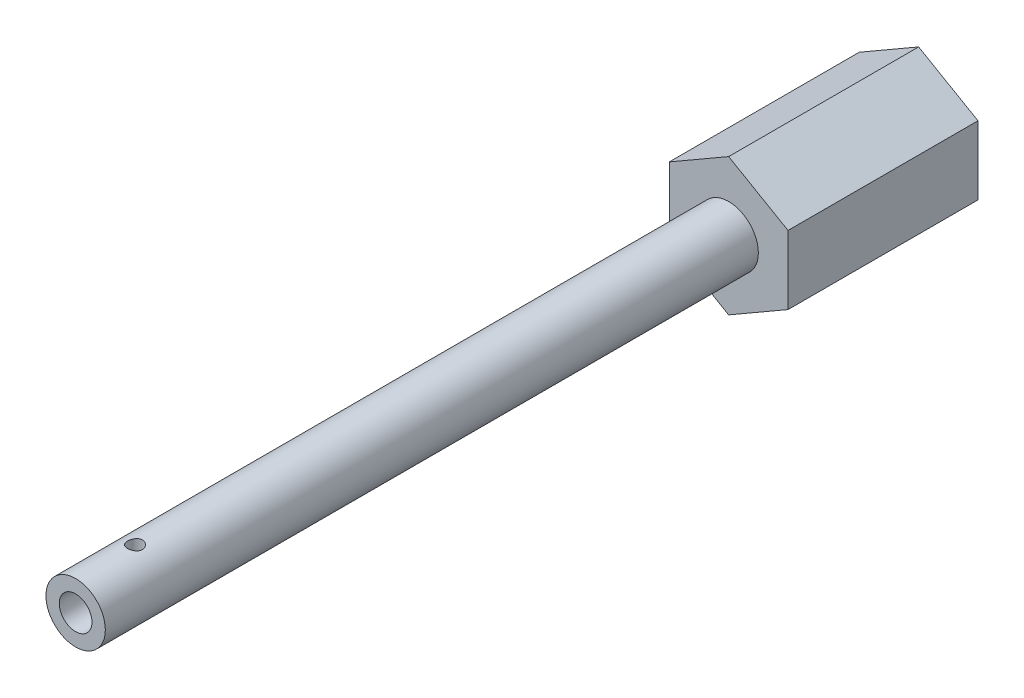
ISO-10303-21;
HEADER;
FILE_DESCRIPTION(('STEP AP214'),'2;1');
FILE_NAME('part.step','',(''),(''),'','','');
FILE_SCHEMA(('AUTOMOTIVE_DESIGN { 1 0 10303 214 1 1 1 1 }'));
ENDSEC;
DATA;
#1=APPLICATION_CONTEXT('core data for automotive mechanical design processes');
#2=APPLICATION_PROTOCOL_DEFINITION('international standard','automotive_design',2000,#1);
#3=PRODUCT_CONTEXT('',#1,'mechanical');
#4=PRODUCT('Part','Part','',(#3));
#5=PRODUCT_RELATED_PRODUCT_CATEGORY('part','',(#4));
#6=PRODUCT_DEFINITION_FORMATION('','',#4);
#7=PRODUCT_DEFINITION_CONTEXT('part definition',#1,'design');
#8=PRODUCT_DEFINITION('design','',#6,#7);
#9=PRODUCT_DEFINITION_SHAPE('','',#8);
#10=(LENGTH_UNIT() NAMED_UNIT(*) SI_UNIT(.MILLI.,.METRE.));
#11=(NAMED_UNIT(*) PLANE_ANGLE_UNIT() SI_UNIT($,.RADIAN.));
#12=(NAMED_UNIT(*) SI_UNIT($,.STERADIAN.) SOLID_ANGLE_UNIT());
#13=UNCERTAINTY_MEASURE_WITH_UNIT(LENGTH_MEASURE(1.E-05),#10,'distance_accuracy_value','');
#14=(GEOMETRIC_REPRESENTATION_CONTEXT(3) GLOBAL_UNCERTAINTY_ASSIGNED_CONTEXT((#13)) GLOBAL_UNIT_ASSIGNED_CONTEXT((#10,
#11,#12)) REPRESENTATION_CONTEXT('',''));
#15=CARTESIAN_POINT('',(0.,0.,0.));
#16=DIRECTION('',(0.,0.,1.));
#17=DIRECTION('',(1.,0.,0.));
#18=AXIS2_PLACEMENT_3D('',#15,#16,#17);
#19=CARTESIAN_POINT('',(6.35000000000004,-3.66617420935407,20.32));
#20=DIRECTION('',(-1.,0.,0.));
#21=DIRECTION('',(0.,-1.,0.));
#22=AXIS2_PLACEMENT_3D('',#19,#20,#21);
#23=PLANE('',#22);
#24=DIRECTION('',(0.,1.,0.));
#25=VECTOR('',#24,1.);
#26=CARTESIAN_POINT('',(6.35000000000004,-3.66617420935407,0.));
#27=LINE('',#26,#25);
#28=CARTESIAN_POINT('',(6.35000000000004,-3.66617420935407,0.));
#29=VERTEX_POINT('',#28);
#30=CARTESIAN_POINT('',(6.34999999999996,3.6661742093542,0.));
#31=VERTEX_POINT('',#30);
#32=EDGE_CURVE('E142',#29,#31,#27,.T.);
#33=ORIENTED_EDGE('',*,*,#32,.T.);
#34=DIRECTION('',(0.,0.,-1.));
#35=VECTOR('',#34,1.);
#36=CARTESIAN_POINT('',(6.34999999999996,3.6661742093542,20.32));
#37=LINE('',#36,#35);
#38=CARTESIAN_POINT('',(6.34999999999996,3.6661742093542,20.32));
#39=VERTEX_POINT('',#38);
#40=EDGE_CURVE('E58',#39,#31,#37,.T.);
#41=ORIENTED_EDGE('',*,*,#40,.F.);
#42=DIRECTION('',(0.,1.,0.));
#43=VECTOR('',#42,1.);
#44=CARTESIAN_POINT('',(6.35000000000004,-3.66617420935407,20.32));
#45=LINE('',#44,#43);
#46=CARTESIAN_POINT('',(6.35000000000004,-3.66617420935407,20.32));
#47=VERTEX_POINT('',#46);
#48=EDGE_CURVE('E159',#47,#39,#45,.T.);
#49=ORIENTED_EDGE('',*,*,#48,.F.);
#50=DIRECTION('',(0.,0.,-1.));
#51=VECTOR('',#50,1.);
#52=CARTESIAN_POINT('',(6.35000000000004,-3.66617420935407,20.32));
#53=LINE('',#52,#51);
#54=EDGE_CURVE('E138',#47,#29,#53,.T.);
#55=ORIENTED_EDGE('',*,*,#54,.T.);
#56=EDGE_LOOP('',(#33,#41,#49,#55));
#57=FACE_BOUND('',#56,.T.);
#58=ADVANCED_FACE('F43',(#57),#23,.F.);
#59=CARTESIAN_POINT('',(6.34999999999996,3.6661742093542,20.32));
#60=DIRECTION('',(-0.499999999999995,-0.866025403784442,0.));
#61=DIRECTION('',(0.866025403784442,-0.499999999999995,0.));
#62=AXIS2_PLACEMENT_3D('',#59,#60,#61);
#63=PLANE('',#62);
#64=DIRECTION('',(-0.866025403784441,0.499999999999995,0.));
#65=VECTOR('',#64,1.);
#66=CARTESIAN_POINT('',(6.34999999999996,3.6661742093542,0.));
#67=LINE('',#66,#65);
#68=CARTESIAN_POINT('',(0.,7.33234841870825,0.));
#69=VERTEX_POINT('',#68);
#70=EDGE_CURVE('E146',#31,#69,#67,.T.);
#71=ORIENTED_EDGE('',*,*,#70,.T.);
#72=DIRECTION('',(0.,0.,-1.));
#73=VECTOR('',#72,1.);
#74=CARTESIAN_POINT('',(0.,7.33234841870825,20.32));
#75=LINE('',#74,#73);
#76=CARTESIAN_POINT('',(0.,7.33234841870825,20.32));
#77=VERTEX_POINT('',#76);
#78=EDGE_CURVE('E166',#77,#69,#75,.T.);
#79=ORIENTED_EDGE('',*,*,#78,.F.);
#80=DIRECTION('',(-0.866025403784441,0.499999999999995,0.));
#81=VECTOR('',#80,1.);
#82=CARTESIAN_POINT('',(6.34999999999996,3.6661742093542,20.32));
#83=LINE('',#82,#81);
#84=EDGE_CURVE('E106',#39,#77,#83,.T.);
#85=ORIENTED_EDGE('',*,*,#84,.F.);
#86=ORIENTED_EDGE('',*,*,#40,.T.);
#87=EDGE_LOOP('',(#71,#79,#85,#86));
#88=FACE_BOUND('',#87,.T.);
#89=ADVANCED_FACE('F226',(#88),#63,.F.);
#90=CARTESIAN_POINT('',(0.,7.33234841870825,20.32));
#91=DIRECTION('',(0.500000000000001,-0.866025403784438,0.));
#92=DIRECTION('',(0.866025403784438,0.500000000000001,0.));
#93=AXIS2_PLACEMENT_3D('',#90,#91,#92);
#94=PLANE('',#93);
#95=DIRECTION('',(-0.866025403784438,-0.500000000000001,0.));
#96=VECTOR('',#95,1.);
#97=CARTESIAN_POINT('',(0.,7.33234841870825,0.));
#98=LINE('',#97,#96);
#99=CARTESIAN_POINT('',(-6.35000000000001,3.66617420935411,0.));
#100=VERTEX_POINT('',#99);
#101=EDGE_CURVE('E150',#69,#100,#98,.T.);
#102=ORIENTED_EDGE('',*,*,#101,.T.);
#103=DIRECTION('',(0.,0.,-1.));
#104=VECTOR('',#103,1.);
#105=CARTESIAN_POINT('',(-6.35000000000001,3.66617420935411,20.32));
#106=LINE('',#105,#104);
#107=CARTESIAN_POINT('',(-6.35000000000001,3.66617420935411,20.32));
#108=VERTEX_POINT('',#107);
#109=EDGE_CURVE('E131',#108,#100,#106,.T.);
#110=ORIENTED_EDGE('',*,*,#109,.F.);
#111=DIRECTION('',(-0.866025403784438,-0.500000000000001,0.));
#112=VECTOR('',#111,1.);
#113=CARTESIAN_POINT('',(0.,7.33234841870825,20.32));
#114=LINE('',#113,#112);
#115=EDGE_CURVE('E120',#77,#108,#114,.T.);
#116=ORIENTED_EDGE('',*,*,#115,.F.);
#117=ORIENTED_EDGE('',*,*,#78,.T.);
#118=EDGE_LOOP('',(#102,#110,#116,#117));
#119=FACE_BOUND('',#118,.T.);
#120=ADVANCED_FACE('F224',(#119),#94,.F.);
#121=CARTESIAN_POINT('',(-6.35000000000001,3.66617420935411,20.32));
#122=DIRECTION('',(1.,0.,0.));
#123=DIRECTION('',(0.,1.,0.));
#124=AXIS2_PLACEMENT_3D('',#121,#122,#123);
#125=PLANE('',#124);
#126=DIRECTION('',(0.,-1.,0.));
#127=VECTOR('',#126,1.);
#128=CARTESIAN_POINT('',(-6.35000000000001,3.66617420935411,0.));
#129=LINE('',#128,#127);
#130=CARTESIAN_POINT('',(-6.34999999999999,-3.66617420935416,0.));
#131=VERTEX_POINT('',#130);
#132=EDGE_CURVE('E129',#100,#131,#129,.T.);
#133=ORIENTED_EDGE('',*,*,#132,.T.);
#134=DIRECTION('',(0.,0.,-1.));
#135=VECTOR('',#134,1.);
#136=CARTESIAN_POINT('',(-6.34999999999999,-3.66617420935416,20.32));
#137=LINE('',#136,#135);
#138=CARTESIAN_POINT('',(-6.34999999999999,-3.66617420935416,20.32));
#139=VERTEX_POINT('',#138);
#140=EDGE_CURVE('E126',#139,#131,#137,.T.);
#141=ORIENTED_EDGE('',*,*,#140,.F.);
#142=DIRECTION('',(0.,-1.,0.));
#143=VECTOR('',#142,1.);
#144=CARTESIAN_POINT('',(-6.35000000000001,3.66617420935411,20.32));
#145=LINE('',#144,#143);
#146=EDGE_CURVE('E114',#108,#139,#145,.T.);
#147=ORIENTED_EDGE('',*,*,#146,.F.);
#148=ORIENTED_EDGE('',*,*,#109,.T.);
#149=EDGE_LOOP('',(#133,#141,#147,#148));
#150=FACE_BOUND('',#149,.T.);
#151=ADVANCED_FACE('F127',(#150),#125,.F.);
#152=CARTESIAN_POINT('',(-6.34999999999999,-3.66617420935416,20.32));
#153=DIRECTION('',(0.499999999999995,0.866025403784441,0.));
#154=DIRECTION('',(-0.866025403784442,0.499999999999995,0.));
#155=AXIS2_PLACEMENT_3D('',#152,#153,#154);
#156=PLANE('',#155);
#157=DIRECTION('',(0.866025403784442,-0.499999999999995,0.));
#158=VECTOR('',#157,1.);
#159=CARTESIAN_POINT('',(-6.34999999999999,-3.66617420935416,0.));
#160=LINE('',#159,#158);
#161=CARTESIAN_POINT('',(0.,-7.33234841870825,0.));
#162=VERTEX_POINT('',#161);
#163=EDGE_CURVE('E91',#131,#162,#160,.T.);
#164=ORIENTED_EDGE('',*,*,#163,.T.);
#165=DIRECTION('',(0.,0.,-1.));
#166=VECTOR('',#165,1.);
#167=CARTESIAN_POINT('',(0.,-7.33234841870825,20.32));
#168=LINE('',#167,#166);
#169=CARTESIAN_POINT('',(0.,-7.33234841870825,20.32));
#170=VERTEX_POINT('',#169);
#171=EDGE_CURVE('E132',#170,#162,#168,.T.);
#172=ORIENTED_EDGE('',*,*,#171,.F.);
#173=DIRECTION('',(0.866025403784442,-0.499999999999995,0.));
#174=VECTOR('',#173,1.);
#175=CARTESIAN_POINT('',(-6.34999999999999,-3.66617420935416,20.32));
#176=LINE('',#175,#174);
#177=EDGE_CURVE('E118',#139,#170,#176,.T.);
#178=ORIENTED_EDGE('',*,*,#177,.F.);
#179=ORIENTED_EDGE('',*,*,#140,.T.);
#180=EDGE_LOOP('',(#164,#172,#178,#179));
#181=FACE_BOUND('',#180,.T.);
#182=ADVANCED_FACE('F134',(#181),#156,.F.);
#183=CARTESIAN_POINT('',(0.,-7.33234841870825,20.32));
#184=DIRECTION('',(-0.500000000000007,0.866025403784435,0.));
#185=DIRECTION('',(-0.866025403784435,-0.500000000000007,0.));
#186=AXIS2_PLACEMENT_3D('',#183,#184,#185);
#187=PLANE('',#186);
#188=DIRECTION('',(0.866025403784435,0.500000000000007,0.));
#189=VECTOR('',#188,1.);
#190=CARTESIAN_POINT('',(0.,-7.33234841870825,0.));
#191=LINE('',#190,#189);
#192=EDGE_CURVE('E97',#162,#29,#191,.T.);
#193=ORIENTED_EDGE('',*,*,#192,.T.);
#194=ORIENTED_EDGE('',*,*,#54,.F.);
#195=DIRECTION('',(0.866025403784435,0.500000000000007,0.));
#196=VECTOR('',#195,1.);
#197=CARTESIAN_POINT('',(0.,-7.33234841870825,20.32));
#198=LINE('',#197,#196);
#199=EDGE_CURVE('E67',#170,#47,#198,.T.);
#200=ORIENTED_EDGE('',*,*,#199,.F.);
#201=ORIENTED_EDGE('',*,*,#171,.T.);
#202=EDGE_LOOP('',(#193,#194,#200,#201));
#203=FACE_BOUND('',#202,.T.);
#204=ADVANCED_FACE('F213',(#203),#187,.F.);
#205=CARTESIAN_POINT('',(0.,0.,20.32));
#206=DIRECTION('',(0.,0.,1.));
#207=DIRECTION('',(1.,0.,0.));
#208=AXIS2_PLACEMENT_3D('',#205,#206,#207);
#209=PLANE('',#208);
#210=CARTESIAN_POINT('',(0.,0.,20.32));
#211=DIRECTION('',(0.,0.,1.));
#212=DIRECTION('',(1.,0.,0.));
#213=AXIS2_PLACEMENT_3D('',#210,#211,#212);
#214=CIRCLE('',#213,3.175);
#215=CARTESIAN_POINT('',(3.175,0.,20.32));
#216=VERTEX_POINT('',#215);
#217=EDGE_CURVE('E11',#216,#216,#214,.T.);
#218=ORIENTED_EDGE('',*,*,#217,.F.);
#219=EDGE_LOOP('',(#218));
#220=FACE_BOUND('',#219,.T.);
#221=ORIENTED_EDGE('',*,*,#48,.T.);
#222=ORIENTED_EDGE('',*,*,#84,.T.);
#223=ORIENTED_EDGE('',*,*,#115,.T.);
#224=ORIENTED_EDGE('',*,*,#146,.T.);
#225=ORIENTED_EDGE('',*,*,#177,.T.);
#226=ORIENTED_EDGE('',*,*,#199,.T.);
#227=EDGE_LOOP('',(#221,#222,#223,#224,#225,#226));
#228=FACE_BOUND('',#227,.T.);
#229=ADVANCED_FACE('F116',(#220,#228),#209,.T.);
#230=CARTESIAN_POINT('',(0.,0.,0.));
#231=DIRECTION('',(0.,0.,1.));
#232=DIRECTION('',(1.,0.,0.));
#233=AXIS2_PLACEMENT_3D('',#230,#231,#232);
#234=PLANE('',#233);
#235=ORIENTED_EDGE('',*,*,#32,.F.);
#236=ORIENTED_EDGE('',*,*,#192,.F.);
#237=ORIENTED_EDGE('',*,*,#163,.F.);
#238=ORIENTED_EDGE('',*,*,#132,.F.);
#239=ORIENTED_EDGE('',*,*,#101,.F.);
#240=ORIENTED_EDGE('',*,*,#70,.F.);
#241=EDGE_LOOP('',(#235,#236,#237,#238,#239,#240));
#242=FACE_BOUND('',#241,.T.);
#243=ADVANCED_FACE('F208',(#242),#234,.F.);
#244=CARTESIAN_POINT('',(0.,0.,90.17));
#245=DIRECTION('',(0.,0.,-1.));
#246=DIRECTION('',(-1.,0.,0.));
#247=AXIS2_PLACEMENT_3D('',#244,#245,#246);
#248=CYLINDRICAL_SURFACE('',#247,3.175);
#249=CARTESIAN_POINT('',(0.,-3.175,84.61375));
#250=CARTESIAN_POINT('',(0.0438552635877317,-3.17499925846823,84.6137487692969));
#251=CARTESIAN_POINT('',(0.0877242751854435,-3.17408230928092,84.6101032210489));
#252=CARTESIAN_POINT('',(0.174205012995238,-3.17051326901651,84.5956391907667));
#253=CARTESIAN_POINT('',(0.216816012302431,-3.167860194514,84.5848166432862));
#254=CARTESIAN_POINT('',(0.299519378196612,-3.16111268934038,84.5563675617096));
#255=CARTESIAN_POINT('',(0.339614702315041,-3.15701999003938,84.5387491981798));
#256=CARTESIAN_POINT('',(0.416280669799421,-3.14782911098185,84.4972373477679));
#257=CARTESIAN_POINT('',(0.452851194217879,-3.14273089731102,84.4733436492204));
#258=CARTESIAN_POINT('',(0.522182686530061,-3.13196506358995,84.4194395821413));
#259=CARTESIAN_POINT('',(0.554860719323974,-3.12628865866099,84.3893242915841));
#260=CARTESIAN_POINT('',(0.61475880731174,-3.11506457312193,84.324056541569));
#261=CARTESIAN_POINT('',(0.64197824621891,-3.10951690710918,84.2889035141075));
#262=CARTESIAN_POINT('',(0.690576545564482,-3.0990898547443,84.2139141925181));
#263=CARTESIAN_POINT('',(0.711862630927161,-3.09422162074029,84.1740160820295));
#264=CARTESIAN_POINT('',(0.747393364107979,-3.08583274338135,84.0910664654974));
#265=CARTESIAN_POINT('',(0.76163913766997,-3.08231188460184,84.0480154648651));
#266=CARTESIAN_POINT('',(0.782401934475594,-3.07710668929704,83.9608940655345));
#267=CARTESIAN_POINT('',(0.789068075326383,-3.07538697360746,83.916861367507));
#268=CARTESIAN_POINT('',(0.794946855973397,-3.07387287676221,83.8282716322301));
#269=CARTESIAN_POINT('',(0.794160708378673,-3.07407818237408,83.7837146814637));
#270=CARTESIAN_POINT('',(0.785276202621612,-3.07635912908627,83.6964841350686));
#271=CARTESIAN_POINT('',(0.777355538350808,-3.07838931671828,83.6537910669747));
#272=CARTESIAN_POINT('',(0.754710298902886,-3.08401883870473,83.5703597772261));
#273=CARTESIAN_POINT('',(0.739985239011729,-3.08761828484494,83.5296216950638));
#274=CARTESIAN_POINT('',(0.703997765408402,-3.09602247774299,83.4507802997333));
#275=CARTESIAN_POINT('',(0.682670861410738,-3.10083902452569,83.4127077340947));
#276=CARTESIAN_POINT('',(0.634130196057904,-3.11112805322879,83.340618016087));
#277=CARTESIAN_POINT('',(0.606915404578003,-3.11660064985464,83.3066015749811));
#278=CARTESIAN_POINT('',(0.546451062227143,-3.12777653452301,83.2425714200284));
#279=CARTESIAN_POINT('',(0.513051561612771,-3.1334819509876,83.2126994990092));
#280=CARTESIAN_POINT('',(0.441648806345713,-3.14433990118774,83.1589537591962));
#281=CARTESIAN_POINT('',(0.403645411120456,-3.14949241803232,83.1350801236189));
#282=CARTESIAN_POINT('',(0.323911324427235,-3.15868966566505,83.0939565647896));
#283=CARTESIAN_POINT('',(0.282168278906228,-3.16273053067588,83.0767296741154));
#284=CARTESIAN_POINT('',(0.196255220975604,-3.16922106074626,83.0495770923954));
#285=CARTESIAN_POINT('',(0.152085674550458,-3.17167103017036,83.0396500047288));
#286=CARTESIAN_POINT('',(0.0637857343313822,-3.17465868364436,83.0275953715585));
#287=CARTESIAN_POINT('',(0.0196832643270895,-3.17524369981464,83.0252747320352));
#288=CARTESIAN_POINT('',(-0.0682798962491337,-3.17457034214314,83.0279692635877));
#289=CARTESIAN_POINT('',(-0.1121406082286,-3.1733121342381,83.0329837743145));
#290=CARTESIAN_POINT('',(-0.19770421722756,-3.1691240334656,83.0500471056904));
#291=CARTESIAN_POINT('',(-0.239429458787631,-3.16621918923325,83.0619905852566));
#292=CARTESIAN_POINT('',(-0.320281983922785,-3.15906523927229,83.0924524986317));
#293=CARTESIAN_POINT('',(-0.359409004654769,-3.15481599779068,83.1109715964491));
#294=CARTESIAN_POINT('',(-0.434722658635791,-3.14533125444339,83.1544332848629));
#295=CARTESIAN_POINT('',(-0.470844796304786,-3.14007958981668,83.1794840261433));
#296=CARTESIAN_POINT('',(-0.538441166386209,-3.12919802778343,83.2351596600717));
#297=CARTESIAN_POINT('',(-0.569914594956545,-3.12356806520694,83.265785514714));
#298=CARTESIAN_POINT('',(-0.628115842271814,-3.11239406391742,83.3326385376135));
#299=CARTESIAN_POINT('',(-0.654708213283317,-3.10685552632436,83.3689847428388));
#300=CARTESIAN_POINT('',(-0.701416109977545,-3.09664564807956,83.4457376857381));
#301=CARTESIAN_POINT('',(-0.721531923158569,-3.09197426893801,83.4861442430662));
#302=CARTESIAN_POINT('',(-0.754565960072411,-3.0840790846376,83.5696542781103));
#303=CARTESIAN_POINT('',(-0.767526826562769,-3.08084672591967,83.6127400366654));
#304=CARTESIAN_POINT('',(-0.785995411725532,-3.07618735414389,83.700572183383));
#305=CARTESIAN_POINT('',(-0.791504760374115,-3.074759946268,83.7453182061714));
#306=CARTESIAN_POINT('',(-0.794828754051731,-3.07390218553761,83.8338223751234));
#307=CARTESIAN_POINT('',(-0.792859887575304,-3.0744156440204,83.8775719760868));
#308=CARTESIAN_POINT('',(-0.781778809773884,-3.07725185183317,83.9640941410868));
#309=CARTESIAN_POINT('',(-0.772666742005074,-3.07957456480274,84.0068667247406));
#310=CARTESIAN_POINT('',(-0.74767615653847,-3.08573625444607,84.0899853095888));
#311=CARTESIAN_POINT('',(-0.731838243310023,-3.08956612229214,84.1303442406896));
#312=CARTESIAN_POINT('',(-0.693877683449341,-3.09831187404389,84.2078608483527));
#313=CARTESIAN_POINT('',(-0.671754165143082,-3.10322790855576,84.2450180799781));
#314=CARTESIAN_POINT('',(-0.621171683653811,-3.11375231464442,84.3161226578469));
#315=CARTESIAN_POINT('',(-0.592562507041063,-3.11937540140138,84.3499609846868));
#316=CARTESIAN_POINT('',(-0.530113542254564,-3.1305924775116,84.4124269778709));
#317=CARTESIAN_POINT('',(-0.496272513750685,-3.13618645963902,84.4410534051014));
#318=CARTESIAN_POINT('',(-0.423580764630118,-3.14683592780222,84.4927884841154));
#319=CARTESIAN_POINT('',(-0.38465041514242,-3.15187982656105,84.5157878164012));
#320=CARTESIAN_POINT('',(-0.303353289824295,-3.16073856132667,84.554878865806));
#321=CARTESIAN_POINT('',(-0.260989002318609,-3.16455427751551,84.5709755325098));
#322=CARTESIAN_POINT('',(-0.18225042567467,-3.16996264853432,84.5934150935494));
#323=CARTESIAN_POINT('',(-0.146251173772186,-3.17183867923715,84.6010241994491));
#324=CARTESIAN_POINT('',(-0.0735044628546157,-3.17435761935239,84.6111919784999));
#325=CARTESIAN_POINT('',(-0.0367570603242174,-3.17500062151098,84.6137510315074));
#326=CARTESIAN_POINT('',(0.,-3.175,84.61375));
#327=B_SPLINE_CURVE_WITH_KNOTS('',3,(#249,#250,#251,#252,#253,#254,#255,#256,#257,#258,#259,
#260,#261,#262,#263,#264,#265,#266,#267,#268,#269,#270,#271,#272,#273,#274,#275,#276,#277,#278,
#279,#280,#281,#282,#283,#284,#285,#286,#287,#288,#289,#290,#291,#292,#293,#294,#295,#296,#297,
#298,#299,#300,#301,#302,#303,#304,#305,#306,#307,#308,#309,#310,#311,#312,#313,#314,#315,#316,
#317,#318,#319,#320,#321,#322,#323,#324,#325,#326),.UNSPECIFIED.,.T.,.F.,(4,2,2,2,2,2,2,2,2,2,2,
2,2,2,2,2,2,2,2,2,2,2,2,2,2,2,2,2,2,2,2,2,2,2,2,2,2,2,4),(0.,0.131431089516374,
0.262936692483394,0.394284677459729,0.525637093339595,0.659418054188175,0.793214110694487,
0.92899784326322,1.06475985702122,1.1978020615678,1.33082261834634,1.46061904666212,
1.59042472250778,1.72154070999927,1.85267965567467,1.98755794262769,2.12244034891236,
2.25778604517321,2.39310583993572,2.5249627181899,2.65680772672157,2.78669895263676,
2.91660329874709,3.04881273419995,3.18104500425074,3.31652302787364,3.45199503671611,
3.58665068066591,3.72127686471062,3.85203583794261,3.98279218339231,4.11277011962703,
4.24276608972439,4.37615317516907,4.50957193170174,4.64540698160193,4.78114446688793,
4.89131103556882,5.00146931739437),.UNSPECIFIED.);
#328=CARTESIAN_POINT('',(0.,-3.175,84.61375));
#329=VERTEX_POINT('',#328);
#330=EDGE_CURVE('E197',#329,#329,#327,.T.);
#331=ORIENTED_EDGE('',*,*,#330,.T.);
#332=EDGE_LOOP('',(#331));
#333=FACE_BOUND('',#332,.T.);
#334=CARTESIAN_POINT('',(0.,3.175,84.61375));
#335=CARTESIAN_POINT('',(-0.0438552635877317,3.17499925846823,84.6137487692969));
#336=CARTESIAN_POINT('',(-0.0877242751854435,3.17408230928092,84.6101032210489));
#337=CARTESIAN_POINT('',(-0.174205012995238,3.17051326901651,84.5956391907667));
#338=CARTESIAN_POINT('',(-0.216816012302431,3.167860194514,84.5848166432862));
#339=CARTESIAN_POINT('',(-0.299519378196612,3.16111268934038,84.5563675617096));
#340=CARTESIAN_POINT('',(-0.339614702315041,3.15701999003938,84.5387491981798));
#341=CARTESIAN_POINT('',(-0.416280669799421,3.14782911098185,84.4972373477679));
#342=CARTESIAN_POINT('',(-0.452851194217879,3.14273089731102,84.4733436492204));
#343=CARTESIAN_POINT('',(-0.522182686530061,3.13196506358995,84.4194395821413));
#344=CARTESIAN_POINT('',(-0.554860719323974,3.12628865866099,84.3893242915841));
#345=CARTESIAN_POINT('',(-0.61475880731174,3.11506457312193,84.324056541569));
#346=CARTESIAN_POINT('',(-0.64197824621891,3.10951690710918,84.2889035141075));
#347=CARTESIAN_POINT('',(-0.690576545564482,3.0990898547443,84.2139141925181));
#348=CARTESIAN_POINT('',(-0.711862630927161,3.09422162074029,84.1740160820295));
#349=CARTESIAN_POINT('',(-0.747393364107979,3.08583274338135,84.0910664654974));
#350=CARTESIAN_POINT('',(-0.76163913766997,3.08231188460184,84.0480154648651));
#351=CARTESIAN_POINT('',(-0.782401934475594,3.07710668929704,83.9608940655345));
#352=CARTESIAN_POINT('',(-0.789068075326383,3.07538697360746,83.916861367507));
#353=CARTESIAN_POINT('',(-0.794946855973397,3.07387287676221,83.8282716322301));
#354=CARTESIAN_POINT('',(-0.794160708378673,3.07407818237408,83.7837146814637));
#355=CARTESIAN_POINT('',(-0.785276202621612,3.07635912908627,83.6964841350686));
#356=CARTESIAN_POINT('',(-0.777355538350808,3.07838931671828,83.6537910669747));
#357=CARTESIAN_POINT('',(-0.754710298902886,3.08401883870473,83.5703597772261));
#358=CARTESIAN_POINT('',(-0.739985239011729,3.08761828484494,83.5296216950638));
#359=CARTESIAN_POINT('',(-0.703997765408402,3.09602247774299,83.4507802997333));
#360=CARTESIAN_POINT('',(-0.682670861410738,3.10083902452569,83.4127077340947));
#361=CARTESIAN_POINT('',(-0.634130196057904,3.11112805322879,83.340618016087));
#362=CARTESIAN_POINT('',(-0.606915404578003,3.11660064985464,83.3066015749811));
#363=CARTESIAN_POINT('',(-0.546451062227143,3.12777653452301,83.2425714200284));
#364=CARTESIAN_POINT('',(-0.513051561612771,3.1334819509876,83.2126994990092));
#365=CARTESIAN_POINT('',(-0.441648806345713,3.14433990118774,83.1589537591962));
#366=CARTESIAN_POINT('',(-0.403645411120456,3.14949241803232,83.1350801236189));
#367=CARTESIAN_POINT('',(-0.323911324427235,3.15868966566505,83.0939565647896));
#368=CARTESIAN_POINT('',(-0.282168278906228,3.16273053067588,83.0767296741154));
#369=CARTESIAN_POINT('',(-0.196255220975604,3.16922106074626,83.0495770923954));
#370=CARTESIAN_POINT('',(-0.152085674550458,3.17167103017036,83.0396500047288));
#371=CARTESIAN_POINT('',(-0.0637857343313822,3.17465868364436,83.0275953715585));
#372=CARTESIAN_POINT('',(-0.0196832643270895,3.17524369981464,83.0252747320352));
#373=CARTESIAN_POINT('',(0.0682798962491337,3.17457034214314,83.0279692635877));
#374=CARTESIAN_POINT('',(0.1121406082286,3.1733121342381,83.0329837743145));
#375=CARTESIAN_POINT('',(0.19770421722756,3.1691240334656,83.0500471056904));
#376=CARTESIAN_POINT('',(0.239429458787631,3.16621918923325,83.0619905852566));
#377=CARTESIAN_POINT('',(0.320281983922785,3.15906523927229,83.0924524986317));
#378=CARTESIAN_POINT('',(0.359409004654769,3.15481599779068,83.1109715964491));
#379=CARTESIAN_POINT('',(0.434722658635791,3.14533125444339,83.1544332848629));
#380=CARTESIAN_POINT('',(0.470844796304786,3.14007958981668,83.1794840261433));
#381=CARTESIAN_POINT('',(0.538441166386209,3.12919802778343,83.2351596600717));
#382=CARTESIAN_POINT('',(0.569914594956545,3.12356806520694,83.265785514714));
#383=CARTESIAN_POINT('',(0.628115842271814,3.11239406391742,83.3326385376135));
#384=CARTESIAN_POINT('',(0.654708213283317,3.10685552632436,83.3689847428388));
#385=CARTESIAN_POINT('',(0.701416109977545,3.09664564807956,83.4457376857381));
#386=CARTESIAN_POINT('',(0.721531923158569,3.09197426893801,83.4861442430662));
#387=CARTESIAN_POINT('',(0.754565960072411,3.0840790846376,83.5696542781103));
#388=CARTESIAN_POINT('',(0.767526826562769,3.08084672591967,83.6127400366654));
#389=CARTESIAN_POINT('',(0.785995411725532,3.07618735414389,83.700572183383));
#390=CARTESIAN_POINT('',(0.791504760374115,3.074759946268,83.7453182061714));
#391=CARTESIAN_POINT('',(0.794828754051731,3.07390218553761,83.8338223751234));
#392=CARTESIAN_POINT('',(0.792859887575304,3.0744156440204,83.8775719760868));
#393=CARTESIAN_POINT('',(0.781778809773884,3.07725185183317,83.9640941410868));
#394=CARTESIAN_POINT('',(0.772666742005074,3.07957456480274,84.0068667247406));
#395=CARTESIAN_POINT('',(0.74767615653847,3.08573625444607,84.0899853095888));
#396=CARTESIAN_POINT('',(0.731838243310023,3.08956612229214,84.1303442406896));
#397=CARTESIAN_POINT('',(0.693877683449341,3.09831187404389,84.2078608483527));
#398=CARTESIAN_POINT('',(0.671754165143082,3.10322790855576,84.2450180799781));
#399=CARTESIAN_POINT('',(0.621171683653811,3.11375231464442,84.3161226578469));
#400=CARTESIAN_POINT('',(0.592562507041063,3.11937540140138,84.3499609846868));
#401=CARTESIAN_POINT('',(0.530113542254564,3.1305924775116,84.4124269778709));
#402=CARTESIAN_POINT('',(0.496272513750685,3.13618645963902,84.4410534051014));
#403=CARTESIAN_POINT('',(0.423580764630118,3.14683592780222,84.4927884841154));
#404=CARTESIAN_POINT('',(0.38465041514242,3.15187982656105,84.5157878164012));
#405=CARTESIAN_POINT('',(0.303353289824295,3.16073856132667,84.554878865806));
#406=CARTESIAN_POINT('',(0.260989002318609,3.16455427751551,84.5709755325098));
#407=CARTESIAN_POINT('',(0.18225042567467,3.16996264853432,84.5934150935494));
#408=CARTESIAN_POINT('',(0.146251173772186,3.17183867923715,84.6010241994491));
#409=CARTESIAN_POINT('',(0.0735044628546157,3.17435761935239,84.6111919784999));
#410=CARTESIAN_POINT('',(0.0367570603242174,3.17500062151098,84.6137510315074));
#411=CARTESIAN_POINT('',(0.,3.175,84.61375));
#412=B_SPLINE_CURVE_WITH_KNOTS('',3,(#334,#335,#336,#337,#338,#339,#340,#341,#342,#343,#344,
#345,#346,#347,#348,#349,#350,#351,#352,#353,#354,#355,#356,#357,#358,#359,#360,#361,#362,#363,
#364,#365,#366,#367,#368,#369,#370,#371,#372,#373,#374,#375,#376,#377,#378,#379,#380,#381,#382,
#383,#384,#385,#386,#387,#388,#389,#390,#391,#392,#393,#394,#395,#396,#397,#398,#399,#400,#401,
#402,#403,#404,#405,#406,#407,#408,#409,#410,#411),.UNSPECIFIED.,.T.,.F.,(4,2,2,2,2,2,2,2,2,2,2,
2,2,2,2,2,2,2,2,2,2,2,2,2,2,2,2,2,2,2,2,2,2,2,2,2,2,2,4),(0.,0.131431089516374,
0.262936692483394,0.394284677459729,0.525637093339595,0.659418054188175,0.793214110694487,
0.92899784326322,1.06475985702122,1.1978020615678,1.33082261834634,1.46061904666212,
1.59042472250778,1.72154070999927,1.85267965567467,1.98755794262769,2.12244034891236,
2.25778604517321,2.39310583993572,2.5249627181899,2.65680772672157,2.78669895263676,
2.91660329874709,3.04881273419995,3.18104500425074,3.31652302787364,3.45199503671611,
3.58665068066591,3.72127686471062,3.85203583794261,3.98279218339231,4.11277011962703,
4.24276608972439,4.37615317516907,4.50957193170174,4.64540698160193,4.78114446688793,
4.89131103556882,5.00146931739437),.UNSPECIFIED.);
#413=CARTESIAN_POINT('',(0.,3.175,84.61375));
#414=VERTEX_POINT('',#413);
#415=EDGE_CURVE('E177',#414,#414,#412,.T.);
#416=ORIENTED_EDGE('',*,*,#415,.T.);
#417=EDGE_LOOP('',(#416));
#418=FACE_BOUND('',#417,.T.);
#419=CARTESIAN_POINT('',(0.,0.,90.17));
#420=DIRECTION('',(0.,0.,1.));
#421=DIRECTION('',(1.,0.,0.));
#422=AXIS2_PLACEMENT_3D('',#419,#420,#421);
#423=CIRCLE('',#422,3.175);
#424=CARTESIAN_POINT('',(3.175,0.,90.17));
#425=VERTEX_POINT('',#424);
#426=EDGE_CURVE('E147',#425,#425,#423,.T.);
#427=ORIENTED_EDGE('',*,*,#426,.F.);
#428=EDGE_LOOP('',(#427));
#429=FACE_BOUND('',#428,.T.);
#430=ORIENTED_EDGE('',*,*,#217,.T.);
#431=EDGE_LOOP('',(#430));
#432=FACE_BOUND('',#431,.T.);
#433=ADVANCED_FACE('F202',(#333,#418,#429,#432),#248,.T.);
#434=CARTESIAN_POINT('',(0.,0.,90.17));
#435=DIRECTION('',(0.,0.,1.));
#436=DIRECTION('',(1.,0.,0.));
#437=AXIS2_PLACEMENT_3D('',#434,#435,#436);
#438=PLANE('',#437);
#439=CARTESIAN_POINT('',(0.,0.,90.17));
#440=DIRECTION('',(0.,0.,1.));
#441=DIRECTION('',(1.,0.,0.));
#442=AXIS2_PLACEMENT_3D('',#439,#440,#441);
#443=CIRCLE('',#442,1.74999999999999);
#444=CARTESIAN_POINT('',(1.74999999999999,0.,90.17));
#445=VERTEX_POINT('',#444);
#446=EDGE_CURVE('E249',#445,#445,#443,.T.);
#447=ORIENTED_EDGE('',*,*,#446,.F.);
#448=EDGE_LOOP('',(#447));
#449=FACE_BOUND('',#448,.T.);
#450=ORIENTED_EDGE('',*,*,#426,.T.);
#451=EDGE_LOOP('',(#450));
#452=FACE_BOUND('',#451,.T.);
#453=ADVANCED_FACE('F207',(#449,#452),#438,.T.);
#454=CARTESIAN_POINT('',(0.,0.,64.77));
#455=DIRECTION('',(0.,0.,1.));
#456=DIRECTION('',(1.,0.,0.));
#457=AXIS2_PLACEMENT_3D('',#454,#455,#456);
#458=CONICAL_SURFACE('',#457,1.75,1.02974425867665);
#459=CARTESIAN_POINT('',(0.,0.,63.7184939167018));
#460=VERTEX_POINT('',#459);
#461=VERTEX_LOOP('',#460);
#462=FACE_BOUND('',#461,.T.);
#463=CARTESIAN_POINT('',(0.,0.,64.77));
#464=DIRECTION('',(0.,0.,1.));
#465=DIRECTION('',(1.,0.,0.));
#466=AXIS2_PLACEMENT_3D('',#463,#464,#465);
#467=CIRCLE('',#466,1.75);
#468=CARTESIAN_POINT('',(1.75,0.,64.77));
#469=VERTEX_POINT('',#468);
#470=EDGE_CURVE('E246',#469,#469,#467,.T.);
#471=ORIENTED_EDGE('',*,*,#470,.T.);
#472=EDGE_LOOP('',(#471));
#473=FACE_BOUND('',#472,.T.);
#474=ADVANCED_FACE('F264',(#462,#473),#458,.F.);
#475=CARTESIAN_POINT('',(0.,0.,90.17));
#476=DIRECTION('',(0.,0.,1.));
#477=DIRECTION('',(1.,0.,0.));
#478=AXIS2_PLACEMENT_3D('',#475,#476,#477);
#479=CYLINDRICAL_SURFACE('',#478,1.74999999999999);
#480=CARTESIAN_POINT('',(0.,-1.74999999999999,84.61375));
#481=CARTESIAN_POINT('',(-0.0421881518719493,-1.74999612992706,84.6137450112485));
#482=CARTESIAN_POINT('',(-0.0844240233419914,-1.74845757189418,84.6103674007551));
#483=CARTESIAN_POINT('',(-0.167683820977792,-1.74245085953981,84.5969863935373));
#484=CARTESIAN_POINT('',(-0.208704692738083,-1.73797588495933,84.5869675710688));
#485=CARTESIAN_POINT('',(-0.288187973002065,-1.72657281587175,84.5607638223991));
#486=CARTESIAN_POINT('',(-0.326659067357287,-1.71965361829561,84.5446012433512));
#487=CARTESIAN_POINT('',(-0.400299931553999,-1.70401847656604,84.5066701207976));
#488=CARTESIAN_POINT('',(-0.435470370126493,-1.69530289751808,84.4849027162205));
#489=CARTESIAN_POINT('',(-0.503587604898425,-1.67636929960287,84.4350703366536));
#490=CARTESIAN_POINT('',(-0.536321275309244,-1.66609648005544,84.4067351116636));
#491=CARTESIAN_POINT('',(-0.596761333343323,-1.64541734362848,84.3451462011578));
#492=CARTESIAN_POINT('',(-0.624464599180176,-1.63501094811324,84.3118894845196));
#493=CARTESIAN_POINT('',(-0.675731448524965,-1.61452640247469,84.2389635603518));
#494=CARTESIAN_POINT('',(-0.698941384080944,-1.60450658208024,84.1990275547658));
#495=CARTESIAN_POINT('',(-0.73822010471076,-1.58682023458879,84.1153040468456));
#496=CARTESIAN_POINT('',(-0.754293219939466,-1.57915228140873,84.071518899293));
#497=CARTESIAN_POINT('',(-0.777922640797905,-1.56764209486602,83.983784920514));
#498=CARTESIAN_POINT('',(-0.785891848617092,-1.56361569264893,83.9399725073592));
#499=CARTESIAN_POINT('',(-0.79436884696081,-1.55932781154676,83.8514619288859));
#500=CARTESIAN_POINT('',(-0.794881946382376,-1.55906365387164,83.8067644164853));
#501=CARTESIAN_POINT('',(-0.788739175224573,-1.56217727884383,83.722252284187));
#502=CARTESIAN_POINT('',(-0.782752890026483,-1.56521493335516,83.6823737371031));
#503=CARTESIAN_POINT('',(-0.764920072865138,-1.57400605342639,83.6042643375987));
#504=CARTESIAN_POINT('',(-0.753072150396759,-1.5797601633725,83.5660338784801));
#505=CARTESIAN_POINT('',(-0.723618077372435,-1.59346942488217,83.4912628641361));
#506=CARTESIAN_POINT('',(-0.705887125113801,-1.60147164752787,83.4547804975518));
#507=CARTESIAN_POINT('',(-0.665260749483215,-1.61876957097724,83.3851509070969));
#508=CARTESIAN_POINT('',(-0.642363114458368,-1.62806582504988,83.3520051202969));
#509=CARTESIAN_POINT('',(-0.589321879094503,-1.64805372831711,83.2864336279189));
#510=CARTESIAN_POINT('',(-0.558677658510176,-1.65879103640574,83.254425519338));
#511=CARTESIAN_POINT('',(-0.492372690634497,-1.67966566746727,83.1958478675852));
#512=CARTESIAN_POINT('',(-0.456710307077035,-1.68980279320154,83.1692801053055));
#513=CARTESIAN_POINT('',(-0.379910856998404,-1.70873607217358,83.1215634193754));
#514=CARTESIAN_POINT('',(-0.338635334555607,-1.71747906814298,83.1006146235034));
#515=CARTESIAN_POINT('',(-0.252647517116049,-1.73221433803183,83.066109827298));
#516=CARTESIAN_POINT('',(-0.207937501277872,-1.73820841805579,83.0525489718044));
#517=CARTESIAN_POINT('',(-0.119812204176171,-1.74641364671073,83.0341488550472));
#518=CARTESIAN_POINT('',(-0.0765361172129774,-1.74886645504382,83.0287510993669));
#519=CARTESIAN_POINT('',(0.0103706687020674,-1.75050807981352,83.0251283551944));
#520=CARTESIAN_POINT('',(0.0540012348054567,-1.74969806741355,83.0269007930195));
#521=CARTESIAN_POINT('',(0.13756101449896,-1.74505663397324,83.0371972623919));
#522=CARTESIAN_POINT('',(0.177553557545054,-1.74141273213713,83.0453024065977));
#523=CARTESIAN_POINT('',(0.255551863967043,-1.73168670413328,83.0674202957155));
#524=CARTESIAN_POINT('',(0.293557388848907,-1.72560428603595,83.0814337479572));
#525=CARTESIAN_POINT('',(0.367846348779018,-1.71133425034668,83.1154089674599));
#526=CARTESIAN_POINT('',(0.404039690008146,-1.70308713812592,83.1355418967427));
#527=CARTESIAN_POINT('',(0.472664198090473,-1.68533289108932,83.1809980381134));
#528=CARTESIAN_POINT('',(0.505093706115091,-1.6758252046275,83.2063235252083));
#529=CARTESIAN_POINT('',(0.568130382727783,-1.65557046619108,83.2639081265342));
#530=CARTESIAN_POINT('',(0.598358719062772,-1.64478624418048,83.2965698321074));
#531=CARTESIAN_POINT('',(0.65303979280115,-1.62385288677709,83.3666200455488));
#532=CARTESIAN_POINT('',(0.677490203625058,-1.61370400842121,83.4040104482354));
#533=CARTESIAN_POINT('',(0.720497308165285,-1.59497662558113,83.4838003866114));
#534=CARTESIAN_POINT('',(0.738877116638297,-1.58644789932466,83.5263078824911));
#535=CARTESIAN_POINT('',(0.76803771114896,-1.57254049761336,83.6143285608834));
#536=CARTESIAN_POINT('',(0.778826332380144,-1.5671585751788,83.6598385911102));
#537=CARTESIAN_POINT('',(0.791656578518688,-1.56071352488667,83.7483078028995));
#538=CARTESIAN_POINT('',(0.794378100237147,-1.55931511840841,83.7911439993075));
#539=CARTESIAN_POINT('',(0.79287844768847,-1.56007851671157,83.8766571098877));
#540=CARTESIAN_POINT('',(0.788658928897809,-1.56223947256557,83.9193340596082));
#541=CARTESIAN_POINT('',(0.773999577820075,-1.569549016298,84.0004194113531));
#542=CARTESIAN_POINT('',(0.763983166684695,-1.57449366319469,84.0389247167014));
#543=CARTESIAN_POINT('',(0.738472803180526,-1.58661785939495,84.1136982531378));
#544=CARTESIAN_POINT('',(0.722977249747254,-1.59379806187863,84.1499658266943));
#545=CARTESIAN_POINT('',(0.685797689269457,-1.61016114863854,84.2218237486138));
#546=CARTESIAN_POINT('',(0.663776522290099,-1.619443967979,84.2572163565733));
#547=CARTESIAN_POINT('',(0.61459781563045,-1.63873942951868,84.3240143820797));
#548=CARTESIAN_POINT('',(0.587438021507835,-1.64875239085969,84.3554180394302));
#549=CARTESIAN_POINT('',(0.525782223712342,-1.6694924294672,84.4163555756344));
#550=CARTESIAN_POINT('',(0.490839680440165,-1.6801997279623,84.4454467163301));
#551=CARTESIAN_POINT('',(0.416203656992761,-1.7002251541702,84.4974073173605));
#552=CARTESIAN_POINT('',(0.376507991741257,-1.70954263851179,84.5202739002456));
#553=CARTESIAN_POINT('',(0.293730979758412,-1.72568368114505,84.5588008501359));
#554=CARTESIAN_POINT('',(0.250683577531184,-1.73252907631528,84.574524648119));
#555=CARTESIAN_POINT('',(0.162241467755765,-1.74302742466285,84.5983319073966));
#556=CARTESIAN_POINT('',(0.116854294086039,-1.74669001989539,84.6064384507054));
#557=CARTESIAN_POINT('',(0.0474686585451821,-1.74951831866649,84.6126875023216));
#558=CARTESIAN_POINT('',(0.0237418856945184,-1.7500021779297,84.6137528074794));
#559=CARTESIAN_POINT('',(0.,-1.74999999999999,84.61375));
#560=B_SPLINE_CURVE_WITH_KNOTS('',3,(#480,#481,#482,#483,#484,#485,#486,#487,#488,#489,#490,
#491,#492,#493,#494,#495,#496,#497,#498,#499,#500,#501,#502,#503,#504,#505,#506,#507,#508,#509,
#510,#511,#512,#513,#514,#515,#516,#517,#518,#519,#520,#521,#522,#523,#524,#525,#526,#527,#528,
#529,#530,#531,#532,#533,#534,#535,#536,#537,#538,#539,#540,#541,#542,#543,#544,#545,#546,#547,
#548,#549,#550,#551,#552,#553,#554,#555,#556,#557,#558,#559),.UNSPECIFIED.,.T.,.F.,(4,2,2,2,2,2,
2,2,2,2,2,2,2,2,2,2,2,2,2,2,2,2,2,2,2,2,2,2,2,2,2,2,2,2,2,2,2,2,2,4),(0.,0.126488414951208,
0.253271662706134,0.37959809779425,0.505898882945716,0.638818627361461,0.771820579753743,
0.912901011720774,1.05389572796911,1.18727956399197,1.3205684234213,1.44132368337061,
1.56210760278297,1.68563783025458,1.80922103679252,1.94539816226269,2.08161979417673,
2.2221913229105,2.36267035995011,2.49301748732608,2.62331783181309,2.7456615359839,
2.86801989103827,2.99417692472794,3.12038934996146,3.25715027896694,3.39396618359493,
3.53447480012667,3.67483817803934,3.80297835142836,3.93108796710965,4.05084636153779,
4.17063977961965,4.29823065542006,4.42587763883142,4.56535001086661,4.7048867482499,
4.84315887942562,4.98101065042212,5.05219351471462),.UNSPECIFIED.);
#561=CARTESIAN_POINT('',(0.,-1.74999999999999,84.61375));
#562=VERTEX_POINT('',#561);
#563=EDGE_CURVE('E46',#562,#562,#560,.T.);
#564=ORIENTED_EDGE('',*,*,#563,.T.);
#565=EDGE_LOOP('',(#564));
#566=FACE_BOUND('',#565,.T.);
#567=CARTESIAN_POINT('',(0.,1.74999999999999,84.61375));
#568=CARTESIAN_POINT('',(0.0421881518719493,1.74999612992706,84.6137450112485));
#569=CARTESIAN_POINT('',(0.0844240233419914,1.74845757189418,84.6103674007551));
#570=CARTESIAN_POINT('',(0.167683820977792,1.74245085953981,84.5969863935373));
#571=CARTESIAN_POINT('',(0.208704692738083,1.73797588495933,84.5869675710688));
#572=CARTESIAN_POINT('',(0.288187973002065,1.72657281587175,84.5607638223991));
#573=CARTESIAN_POINT('',(0.326659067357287,1.71965361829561,84.5446012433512));
#574=CARTESIAN_POINT('',(0.400299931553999,1.70401847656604,84.5066701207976));
#575=CARTESIAN_POINT('',(0.435470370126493,1.69530289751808,84.4849027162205));
#576=CARTESIAN_POINT('',(0.503587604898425,1.67636929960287,84.4350703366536));
#577=CARTESIAN_POINT('',(0.536321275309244,1.66609648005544,84.4067351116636));
#578=CARTESIAN_POINT('',(0.596761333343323,1.64541734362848,84.3451462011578));
#579=CARTESIAN_POINT('',(0.624464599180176,1.63501094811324,84.3118894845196));
#580=CARTESIAN_POINT('',(0.675731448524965,1.61452640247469,84.2389635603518));
#581=CARTESIAN_POINT('',(0.698941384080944,1.60450658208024,84.1990275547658));
#582=CARTESIAN_POINT('',(0.73822010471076,1.58682023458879,84.1153040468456));
#583=CARTESIAN_POINT('',(0.754293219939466,1.57915228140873,84.071518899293));
#584=CARTESIAN_POINT('',(0.777922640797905,1.56764209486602,83.983784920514));
#585=CARTESIAN_POINT('',(0.785891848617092,1.56361569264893,83.9399725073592));
#586=CARTESIAN_POINT('',(0.79436884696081,1.55932781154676,83.8514619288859));
#587=CARTESIAN_POINT('',(0.794881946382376,1.55906365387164,83.8067644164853));
#588=CARTESIAN_POINT('',(0.788739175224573,1.56217727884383,83.722252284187));
#589=CARTESIAN_POINT('',(0.782752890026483,1.56521493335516,83.6823737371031));
#590=CARTESIAN_POINT('',(0.764920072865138,1.57400605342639,83.6042643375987));
#591=CARTESIAN_POINT('',(0.753072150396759,1.5797601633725,83.5660338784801));
#592=CARTESIAN_POINT('',(0.723618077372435,1.59346942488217,83.4912628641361));
#593=CARTESIAN_POINT('',(0.705887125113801,1.60147164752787,83.4547804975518));
#594=CARTESIAN_POINT('',(0.665260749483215,1.61876957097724,83.3851509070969));
#595=CARTESIAN_POINT('',(0.642363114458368,1.62806582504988,83.3520051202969));
#596=CARTESIAN_POINT('',(0.589321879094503,1.64805372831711,83.2864336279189));
#597=CARTESIAN_POINT('',(0.558677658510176,1.65879103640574,83.254425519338));
#598=CARTESIAN_POINT('',(0.492372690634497,1.67966566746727,83.1958478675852));
#599=CARTESIAN_POINT('',(0.456710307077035,1.68980279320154,83.1692801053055));
#600=CARTESIAN_POINT('',(0.379910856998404,1.70873607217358,83.1215634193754));
#601=CARTESIAN_POINT('',(0.338635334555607,1.71747906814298,83.1006146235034));
#602=CARTESIAN_POINT('',(0.252647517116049,1.73221433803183,83.066109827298));
#603=CARTESIAN_POINT('',(0.207937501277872,1.73820841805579,83.0525489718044));
#604=CARTESIAN_POINT('',(0.119812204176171,1.74641364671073,83.0341488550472));
#605=CARTESIAN_POINT('',(0.0765361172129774,1.74886645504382,83.0287510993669));
#606=CARTESIAN_POINT('',(-0.0103706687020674,1.75050807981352,83.0251283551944));
#607=CARTESIAN_POINT('',(-0.0540012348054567,1.74969806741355,83.0269007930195));
#608=CARTESIAN_POINT('',(-0.13756101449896,1.74505663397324,83.0371972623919));
#609=CARTESIAN_POINT('',(-0.177553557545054,1.74141273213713,83.0453024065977));
#610=CARTESIAN_POINT('',(-0.255551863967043,1.73168670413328,83.0674202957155));
#611=CARTESIAN_POINT('',(-0.293557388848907,1.72560428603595,83.0814337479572));
#612=CARTESIAN_POINT('',(-0.367846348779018,1.71133425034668,83.1154089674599));
#613=CARTESIAN_POINT('',(-0.404039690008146,1.70308713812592,83.1355418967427));
#614=CARTESIAN_POINT('',(-0.472664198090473,1.68533289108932,83.1809980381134));
#615=CARTESIAN_POINT('',(-0.505093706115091,1.6758252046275,83.2063235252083));
#616=CARTESIAN_POINT('',(-0.568130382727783,1.65557046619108,83.2639081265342));
#617=CARTESIAN_POINT('',(-0.598358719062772,1.64478624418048,83.2965698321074));
#618=CARTESIAN_POINT('',(-0.65303979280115,1.62385288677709,83.3666200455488));
#619=CARTESIAN_POINT('',(-0.677490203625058,1.61370400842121,83.4040104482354));
#620=CARTESIAN_POINT('',(-0.720497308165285,1.59497662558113,83.4838003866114));
#621=CARTESIAN_POINT('',(-0.738877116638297,1.58644789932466,83.5263078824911));
#622=CARTESIAN_POINT('',(-0.76803771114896,1.57254049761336,83.6143285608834));
#623=CARTESIAN_POINT('',(-0.778826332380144,1.5671585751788,83.6598385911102));
#624=CARTESIAN_POINT('',(-0.791656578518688,1.56071352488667,83.7483078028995));
#625=CARTESIAN_POINT('',(-0.794378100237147,1.55931511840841,83.7911439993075));
#626=CARTESIAN_POINT('',(-0.79287844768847,1.56007851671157,83.8766571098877));
#627=CARTESIAN_POINT('',(-0.788658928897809,1.56223947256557,83.9193340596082));
#628=CARTESIAN_POINT('',(-0.773999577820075,1.569549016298,84.0004194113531));
#629=CARTESIAN_POINT('',(-0.763983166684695,1.57449366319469,84.0389247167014));
#630=CARTESIAN_POINT('',(-0.738472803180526,1.58661785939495,84.1136982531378));
#631=CARTESIAN_POINT('',(-0.722977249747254,1.59379806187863,84.1499658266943));
#632=CARTESIAN_POINT('',(-0.685797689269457,1.61016114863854,84.2218237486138));
#633=CARTESIAN_POINT('',(-0.663776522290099,1.619443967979,84.2572163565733));
#634=CARTESIAN_POINT('',(-0.61459781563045,1.63873942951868,84.3240143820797));
#635=CARTESIAN_POINT('',(-0.587438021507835,1.64875239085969,84.3554180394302));
#636=CARTESIAN_POINT('',(-0.525782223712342,1.6694924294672,84.4163555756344));
#637=CARTESIAN_POINT('',(-0.490839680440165,1.6801997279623,84.4454467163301));
#638=CARTESIAN_POINT('',(-0.416203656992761,1.7002251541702,84.4974073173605));
#639=CARTESIAN_POINT('',(-0.376507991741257,1.70954263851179,84.5202739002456));
#640=CARTESIAN_POINT('',(-0.293730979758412,1.72568368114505,84.5588008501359));
#641=CARTESIAN_POINT('',(-0.250683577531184,1.73252907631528,84.574524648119));
#642=CARTESIAN_POINT('',(-0.162241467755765,1.74302742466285,84.5983319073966));
#643=CARTESIAN_POINT('',(-0.116854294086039,1.74669001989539,84.6064384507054));
#644=CARTESIAN_POINT('',(-0.0474686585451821,1.74951831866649,84.6126875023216));
#645=CARTESIAN_POINT('',(-0.0237418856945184,1.7500021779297,84.6137528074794));
#646=CARTESIAN_POINT('',(0.,1.74999999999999,84.61375));
#647=B_SPLINE_CURVE_WITH_KNOTS('',3,(#567,#568,#569,#570,#571,#572,#573,#574,#575,#576,#577,
#578,#579,#580,#581,#582,#583,#584,#585,#586,#587,#588,#589,#590,#591,#592,#593,#594,#595,#596,
#597,#598,#599,#600,#601,#602,#603,#604,#605,#606,#607,#608,#609,#610,#611,#612,#613,#614,#615,
#616,#617,#618,#619,#620,#621,#622,#623,#624,#625,#626,#627,#628,#629,#630,#631,#632,#633,#634,
#635,#636,#637,#638,#639,#640,#641,#642,#643,#644,#645,#646),.UNSPECIFIED.,.T.,.F.,(4,2,2,2,2,2,
2,2,2,2,2,2,2,2,2,2,2,2,2,2,2,2,2,2,2,2,2,2,2,2,2,2,2,2,2,2,2,2,2,4),(0.,0.126488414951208,
0.253271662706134,0.37959809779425,0.505898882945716,0.638818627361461,0.771820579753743,
0.912901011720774,1.05389572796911,1.18727956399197,1.3205684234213,1.44132368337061,
1.56210760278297,1.68563783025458,1.80922103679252,1.94539816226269,2.08161979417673,
2.2221913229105,2.36267035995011,2.49301748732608,2.62331783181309,2.7456615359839,
2.86801989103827,2.99417692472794,3.12038934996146,3.25715027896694,3.39396618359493,
3.53447480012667,3.67483817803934,3.80297835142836,3.93108796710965,4.05084636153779,
4.17063977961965,4.29823065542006,4.42587763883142,4.56535001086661,4.7048867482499,
4.84315887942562,4.98101065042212,5.05219351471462),.UNSPECIFIED.);
#648=CARTESIAN_POINT('',(0.,1.74999999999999,84.61375));
#649=VERTEX_POINT('',#648);
#650=EDGE_CURVE('E171',#649,#649,#647,.T.);
#651=ORIENTED_EDGE('',*,*,#650,.T.);
#652=EDGE_LOOP('',(#651));
#653=FACE_BOUND('',#652,.T.);
#654=ORIENTED_EDGE('',*,*,#470,.F.);
#655=EDGE_LOOP('',(#654));
#656=FACE_BOUND('',#655,.T.);
#657=ORIENTED_EDGE('',*,*,#446,.T.);
#658=EDGE_LOOP('',(#657));
#659=FACE_BOUND('',#658,.T.);
#660=ADVANCED_FACE('F178',(#566,#653,#656,#659),#479,.F.);
#661=CARTESIAN_POINT('',(0.,7.62,83.82));
#662=DIRECTION('',(0.,1.,0.));
#663=DIRECTION('',(0.,0.,1.));
#664=AXIS2_PLACEMENT_3D('',#661,#662,#663);
#665=CYLINDRICAL_SURFACE('',#664,0.793749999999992);
#666=ORIENTED_EDGE('',*,*,#650,.F.);
#667=EDGE_LOOP('',(#666));
#668=FACE_BOUND('',#667,.T.);
#669=ORIENTED_EDGE('',*,*,#415,.F.);
#670=EDGE_LOOP('',(#669));
#671=FACE_BOUND('',#670,.T.);
#672=ADVANCED_FACE('F184',(#668,#671),#665,.F.);
#673=ORIENTED_EDGE('',*,*,#563,.F.);
#674=EDGE_LOOP('',(#673));
#675=FACE_BOUND('',#674,.T.);
#676=ORIENTED_EDGE('',*,*,#330,.F.);
#677=EDGE_LOOP('',(#676));
#678=FACE_BOUND('',#677,.T.);
#679=ADVANCED_FACE('F181',(#675,#678),#665,.F.);
#680=CLOSED_SHELL('',(#58,#89,#120,#151,#182,#204,#229,#243,#433,#453,#474,#660,#672,#679));
#681=MANIFOLD_SOLID_BREP('B2',#680);
#682=ADVANCED_BREP_SHAPE_REPRESENTATION('',(#18,#681),#14);
#683=SHAPE_DEFINITION_REPRESENTATION(#9,#682);
ENDSEC;
END-ISO-10303-21;
